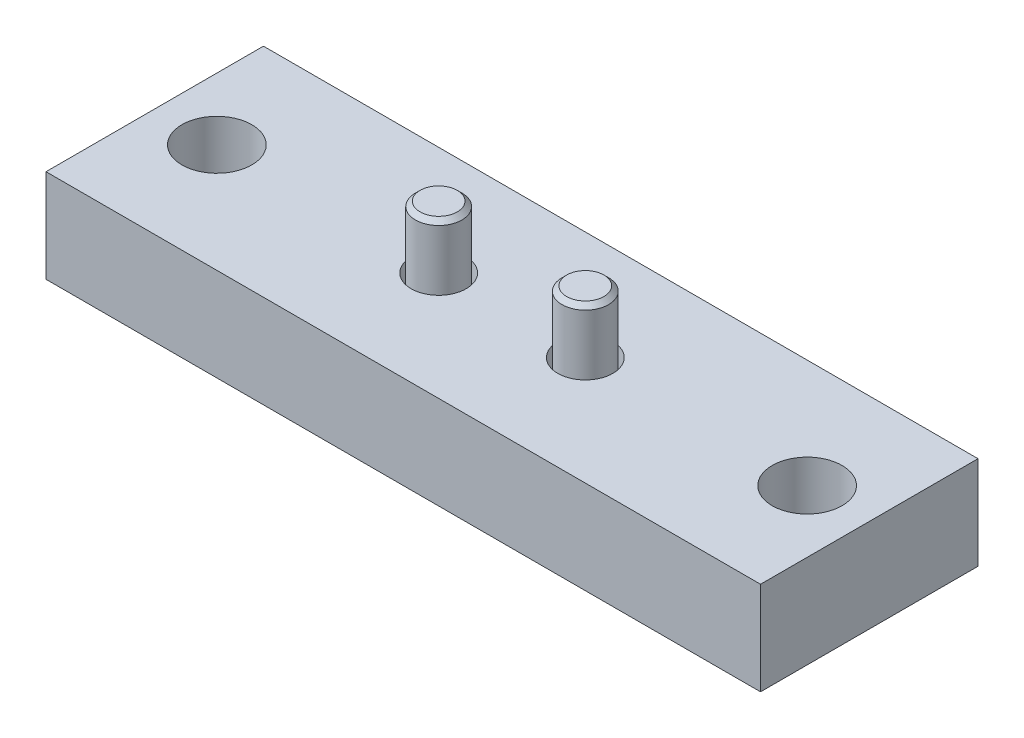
ISO-10303-21;
HEADER;
FILE_DESCRIPTION(('STEP AP214'),'2;1');
FILE_NAME('part.step','',(''),(''),'','','');
FILE_SCHEMA(('AUTOMOTIVE_DESIGN { 1 0 10303 214 1 1 1 1 }'));
ENDSEC;
DATA;
#1=APPLICATION_CONTEXT('core data for automotive mechanical design processes');
#2=APPLICATION_PROTOCOL_DEFINITION('international standard','automotive_design',2000,#1);
#3=PRODUCT_CONTEXT('',#1,'mechanical');
#4=PRODUCT('Part','Part','',(#3));
#5=PRODUCT_RELATED_PRODUCT_CATEGORY('part','',(#4));
#6=PRODUCT_DEFINITION_FORMATION('','',#4);
#7=PRODUCT_DEFINITION_CONTEXT('part definition',#1,'design');
#8=PRODUCT_DEFINITION('design','',#6,#7);
#9=PRODUCT_DEFINITION_SHAPE('','',#8);
#10=(LENGTH_UNIT() NAMED_UNIT(*) SI_UNIT(.MILLI.,.METRE.));
#11=(NAMED_UNIT(*) PLANE_ANGLE_UNIT() SI_UNIT($,.RADIAN.));
#12=(NAMED_UNIT(*) SI_UNIT($,.STERADIAN.) SOLID_ANGLE_UNIT());
#13=UNCERTAINTY_MEASURE_WITH_UNIT(LENGTH_MEASURE(1.E-05),#10,'distance_accuracy_value','');
#14=(GEOMETRIC_REPRESENTATION_CONTEXT(3) GLOBAL_UNCERTAINTY_ASSIGNED_CONTEXT((#13)) GLOBAL_UNIT_ASSIGNED_CONTEXT((#10,
#11,#12)) REPRESENTATION_CONTEXT('',''));
#15=CARTESIAN_POINT('',(0.,0.,0.));
#16=DIRECTION('',(0.,0.,1.));
#17=DIRECTION('',(1.,0.,0.));
#18=AXIS2_PLACEMENT_3D('',#15,#16,#17);
#19=CARTESIAN_POINT('',(14.986,-19.05,0.));
#20=DIRECTION('',(0.,-1.,0.));
#21=DIRECTION('',(-0.5,0.,0.866025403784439));
#22=AXIS2_PLACEMENT_3D('',#19,#20,#21);
#23=PLANE('',#22);
#24=CARTESIAN_POINT('',(14.986,-19.05,0.));
#25=DIRECTION('',(0.,-1.,0.));
#26=DIRECTION('',(-0.5,0.,0.866025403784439));
#27=AXIS2_PLACEMENT_3D('',#24,#25,#26);
#28=CIRCLE('',#27,9.9187);
#29=CARTESIAN_POINT('',(10.02665,-19.05,8.58984617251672));
#30=VERTEX_POINT('',#29);
#31=EDGE_CURVE('P0_E156',#30,#30,#28,.T.);
#32=ORIENTED_EDGE('',*,*,#31,.T.);
#33=EDGE_LOOP('',(#32));
#34=FACE_BOUND('',#33,.T.);
#35=DIRECTION('',(0.866025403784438,0.,-0.5));
#36=VECTOR('',#35,1.);
#37=CARTESIAN_POINT('',(14.986,-19.05,3.20790243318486));
#38=LINE('',#37,#36);
#39=CARTESIAN_POINT('',(14.986,-19.05,3.20790243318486));
#40=VERTEX_POINT('',#39);
#41=CARTESIAN_POINT('',(17.764125,-19.05,1.60395121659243));
#42=VERTEX_POINT('',#41);
#43=EDGE_CURVE('P0_E112',#40,#42,#38,.T.);
#44=ORIENTED_EDGE('',*,*,#43,.T.);
#45=DIRECTION('',(0.,0.,-1.));
#46=VECTOR('',#45,1.);
#47=CARTESIAN_POINT('',(17.764125,-19.05,1.60395121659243));
#48=LINE('',#47,#46);
#49=CARTESIAN_POINT('',(17.764125,-19.05,-1.60395121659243));
#50=VERTEX_POINT('',#49);
#51=EDGE_CURVE('P0_E30',#42,#50,#48,.T.);
#52=ORIENTED_EDGE('',*,*,#51,.T.);
#53=DIRECTION('',(-0.866025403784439,0.,-0.5));
#54=VECTOR('',#53,1.);
#55=CARTESIAN_POINT('',(17.764125,-19.05,-1.60395121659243));
#56=LINE('',#55,#54);
#57=CARTESIAN_POINT('',(14.986,-19.05,-3.20790243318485));
#58=VERTEX_POINT('',#57);
#59=EDGE_CURVE('P0_E93',#50,#58,#56,.T.);
#60=ORIENTED_EDGE('',*,*,#59,.T.);
#61=DIRECTION('',(-0.866025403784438,0.,0.5));
#62=VECTOR('',#61,1.);
#63=CARTESIAN_POINT('',(14.986,-19.05,-3.20790243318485));
#64=LINE('',#63,#62);
#65=CARTESIAN_POINT('',(12.207875,-19.05,-1.60395121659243));
#66=VERTEX_POINT('',#65);
#67=EDGE_CURVE('P0_E101',#58,#66,#64,.T.);
#68=ORIENTED_EDGE('',*,*,#67,.T.);
#69=DIRECTION('',(0.,0.,1.));
#70=VECTOR('',#69,1.);
#71=CARTESIAN_POINT('',(12.207875,-19.05,-1.60395121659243));
#72=LINE('',#71,#70);
#73=CARTESIAN_POINT('',(12.207875,-19.05,1.60395121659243));
#74=VERTEX_POINT('',#73);
#75=EDGE_CURVE('P0_E116',#66,#74,#72,.T.);
#76=ORIENTED_EDGE('',*,*,#75,.T.);
#77=DIRECTION('',(0.866025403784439,0.,0.5));
#78=VECTOR('',#77,1.);
#79=CARTESIAN_POINT('',(12.207875,-19.05,1.60395121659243));
#80=LINE('',#79,#78);
#81=EDGE_CURVE('P0_E119',#74,#40,#80,.T.);
#82=ORIENTED_EDGE('',*,*,#81,.T.);
#83=EDGE_LOOP('',(#44,#52,#60,#68,#76,#82));
#84=FACE_BOUND('',#83,.T.);
#85=ADVANCED_FACE('P0_F15',(#34,#84),#23,.T.);
#86=CARTESIAN_POINT('',(11.6864432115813,12.7,-1.905));
#87=DIRECTION('',(0.,1.,0.));
#88=DIRECTION('',(0.5,0.,-0.866025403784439));
#89=AXIS2_PLACEMENT_3D('',#86,#87,#88);
#90=PLANE('',#89);
#91=CARTESIAN_POINT('',(14.986,12.7,0.));
#92=DIRECTION('',(0.,-1.,0.));
#93=DIRECTION('',(-0.5,0.,0.866025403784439));
#94=AXIS2_PLACEMENT_3D('',#91,#92,#93);
#95=CIRCLE('',#94,3.81);
#96=CARTESIAN_POINT('',(13.081,12.7,3.29955678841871));
#97=VERTEX_POINT('',#96);
#98=EDGE_CURVE('P0_E10',#97,#97,#95,.T.);
#99=ORIENTED_EDGE('',*,*,#98,.F.);
#100=EDGE_LOOP('',(#99));
#101=FACE_BOUND('',#100,.T.);
#102=ADVANCED_FACE('P0_F17',(#101),#90,.T.);
#103=CARTESIAN_POINT('',(14.986,12.7,0.));
#104=DIRECTION('',(0.,-1.,0.));
#105=DIRECTION('',(-0.5,0.,0.866025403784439));
#106=AXIS2_PLACEMENT_3D('',#103,#104,#105);
#107=CONICAL_SURFACE('',#106,3.81,0.785398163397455);
#108=CARTESIAN_POINT('',(14.986,11.7475,0.));
#109=DIRECTION('',(0.,-1.,0.));
#110=DIRECTION('',(-0.5,0.,0.866025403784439));
#111=AXIS2_PLACEMENT_3D('',#108,#109,#110);
#112=CIRCLE('',#111,4.7625);
#113=CARTESIAN_POINT('',(12.60475,11.7475,4.12444598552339));
#114=VERTEX_POINT('',#113);
#115=EDGE_CURVE('P0_E23',#114,#114,#112,.T.);
#116=ORIENTED_EDGE('',*,*,#115,.F.);
#117=EDGE_LOOP('',(#116));
#118=FACE_BOUND('',#117,.T.);
#119=ORIENTED_EDGE('',*,*,#98,.T.);
#120=EDGE_LOOP('',(#119));
#121=FACE_BOUND('',#120,.T.);
#122=ADVANCED_FACE('P0_F171',(#118,#121),#107,.T.);
#123=CARTESIAN_POINT('',(14.986,-19.05,0.));
#124=DIRECTION('',(0.,-1.,0.));
#125=DIRECTION('',(-0.5,0.,0.866025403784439));
#126=AXIS2_PLACEMENT_3D('',#123,#124,#125);
#127=CYLINDRICAL_SURFACE('',#126,4.7625);
#128=ORIENTED_EDGE('',*,*,#115,.T.);
#129=EDGE_LOOP('',(#128));
#130=FACE_BOUND('',#129,.T.);
#131=CARTESIAN_POINT('',(14.986,-13.09497,0.));
#132=DIRECTION('',(0.,-1.,0.));
#133=DIRECTION('',(-0.5,0.,0.866025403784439));
#134=AXIS2_PLACEMENT_3D('',#131,#132,#133);
#135=CIRCLE('',#134,4.7625);
#136=CARTESIAN_POINT('',(12.60475,-13.09497,4.12444598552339));
#137=VERTEX_POINT('',#136);
#138=EDGE_CURVE('P0_E163',#137,#137,#135,.T.);
#139=ORIENTED_EDGE('',*,*,#138,.F.);
#140=EDGE_LOOP('',(#139));
#141=FACE_BOUND('',#140,.T.);
#142=ADVANCED_FACE('P0_F168',(#130,#141),#127,.T.);
#143=CARTESIAN_POINT('',(14.986,-19.026499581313,0.));
#144=DIRECTION('',(0.,-1.,0.));
#145=DIRECTION('',(-0.5,0.,0.866025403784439));
#146=AXIS2_PLACEMENT_3D('',#143,#144,#145);
#147=CONICAL_SURFACE('',#146,9.9187,0.715584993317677);
#148=ORIENTED_EDGE('',*,*,#138,.T.);
#149=EDGE_LOOP('',(#148));
#150=FACE_BOUND('',#149,.T.);
#151=CARTESIAN_POINT('',(14.986,-19.026499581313,0.));
#152=DIRECTION('',(0.,-1.,0.));
#153=DIRECTION('',(-0.5,0.,0.866025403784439));
#154=AXIS2_PLACEMENT_3D('',#151,#152,#153);
#155=CIRCLE('',#154,9.9187);
#156=CARTESIAN_POINT('',(10.02665,-19.026499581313,8.58984617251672));
#157=VERTEX_POINT('',#156);
#158=EDGE_CURVE('P0_E160',#157,#157,#155,.T.);
#159=ORIENTED_EDGE('',*,*,#158,.F.);
#160=EDGE_LOOP('',(#159));
#161=FACE_BOUND('',#160,.T.);
#162=ADVANCED_FACE('P0_F192',(#150,#161),#147,.T.);
#163=CARTESIAN_POINT('',(14.986,-19.05,0.));
#164=DIRECTION('',(0.,-1.,0.));
#165=DIRECTION('',(-0.5,0.,0.866025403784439));
#166=AXIS2_PLACEMENT_3D('',#163,#164,#165);
#167=CYLINDRICAL_SURFACE('',#166,9.9187);
#168=ORIENTED_EDGE('',*,*,#158,.T.);
#169=EDGE_LOOP('',(#168));
#170=FACE_BOUND('',#169,.T.);
#171=ORIENTED_EDGE('',*,*,#31,.F.);
#172=EDGE_LOOP('',(#171));
#173=FACE_BOUND('',#172,.T.);
#174=ADVANCED_FACE('P0_F189',(#170,#173),#167,.T.);
#175=CARTESIAN_POINT('',(17.764125,-15.621,1.60395121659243));
#176=DIRECTION('',(-1.,0.,0.));
#177=DIRECTION('',(0.,0.,1.));
#178=AXIS2_PLACEMENT_3D('',#175,#176,#177);
#179=PLANE('',#178);
#180=ORIENTED_EDGE('',*,*,#51,.F.);
#181=DIRECTION('',(0.,-1.,0.));
#182=VECTOR('',#181,1.);
#183=CARTESIAN_POINT('',(17.764125,-15.621,1.60395121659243));
#184=LINE('',#183,#182);
#185=CARTESIAN_POINT('',(17.764125,-15.621,1.60395121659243));
#186=VERTEX_POINT('',#185);
#187=EDGE_CURVE('P0_E141',#186,#42,#184,.T.);
#188=ORIENTED_EDGE('',*,*,#187,.F.);
#189=DIRECTION('',(0.,0.,-1.));
#190=VECTOR('',#189,1.);
#191=CARTESIAN_POINT('',(17.764125,-15.621,1.60395121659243));
#192=LINE('',#191,#190);
#193=CARTESIAN_POINT('',(17.764125,-15.621,0.));
#194=VERTEX_POINT('',#193);
#195=EDGE_CURVE('P0_E122',#186,#194,#192,.T.);
#196=ORIENTED_EDGE('',*,*,#195,.T.);
#197=CARTESIAN_POINT('',(17.764125,-15.621,-1.60395121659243));
#198=VERTEX_POINT('',#197);
#199=EDGE_CURVE('P0_E106',#194,#198,#192,.T.);
#200=ORIENTED_EDGE('',*,*,#199,.T.);
#201=DIRECTION('',(0.,-1.,0.));
#202=VECTOR('',#201,1.);
#203=CARTESIAN_POINT('',(17.764125,-15.621,-1.60395121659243));
#204=LINE('',#203,#202);
#205=EDGE_CURVE('P0_E96',#198,#50,#204,.T.);
#206=ORIENTED_EDGE('',*,*,#205,.T.);
#207=EDGE_LOOP('',(#180,#188,#196,#200,#206));
#208=FACE_BOUND('',#207,.T.);
#209=ADVANCED_FACE('P0_F103',(#208),#179,.T.);
#210=CARTESIAN_POINT('',(17.764125,-15.621,-1.60395121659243));
#211=DIRECTION('',(-0.5,0.,0.866025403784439));
#212=DIRECTION('',(0.866025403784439,0.,0.5));
#213=AXIS2_PLACEMENT_3D('',#210,#211,#212);
#214=PLANE('',#213);
#215=ORIENTED_EDGE('',*,*,#59,.F.);
#216=ORIENTED_EDGE('',*,*,#205,.F.);
#217=DIRECTION('',(-0.866025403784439,0.,-0.5));
#218=VECTOR('',#217,1.);
#219=CARTESIAN_POINT('',(17.764125,-15.621,-1.60395121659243));
#220=LINE('',#219,#218);
#221=CARTESIAN_POINT('',(16.3750625,-15.621,-2.40592682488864));
#222=VERTEX_POINT('',#221);
#223=EDGE_CURVE('P0_E125',#198,#222,#220,.T.);
#224=ORIENTED_EDGE('',*,*,#223,.T.);
#225=CARTESIAN_POINT('',(14.986,-15.621,-3.20790243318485));
#226=VERTEX_POINT('',#225);
#227=EDGE_CURVE('P0_E124',#222,#226,#220,.T.);
#228=ORIENTED_EDGE('',*,*,#227,.T.);
#229=DIRECTION('',(0.,-1.,0.));
#230=VECTOR('',#229,1.);
#231=CARTESIAN_POINT('',(14.986,-15.621,-3.20790243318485));
#232=LINE('',#231,#230);
#233=EDGE_CURVE('P0_E98',#226,#58,#232,.T.);
#234=ORIENTED_EDGE('',*,*,#233,.T.);
#235=EDGE_LOOP('',(#215,#216,#224,#228,#234));
#236=FACE_BOUND('',#235,.T.);
#237=ADVANCED_FACE('P0_F94',(#236),#214,.T.);
#238=CARTESIAN_POINT('',(14.986,-15.621,-3.20790243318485));
#239=DIRECTION('',(0.5,0.,0.866025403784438));
#240=DIRECTION('',(0.866025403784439,0.,-0.5));
#241=AXIS2_PLACEMENT_3D('',#238,#239,#240);
#242=PLANE('',#241);
#243=ORIENTED_EDGE('',*,*,#67,.F.);
#244=ORIENTED_EDGE('',*,*,#233,.F.);
#245=DIRECTION('',(-0.866025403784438,0.,0.5));
#246=VECTOR('',#245,1.);
#247=CARTESIAN_POINT('',(14.986,-15.621,-3.20790243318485));
#248=LINE('',#247,#246);
#249=CARTESIAN_POINT('',(13.5969375,-15.621,-2.40592682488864));
#250=VERTEX_POINT('',#249);
#251=EDGE_CURVE('P0_E128',#226,#250,#248,.T.);
#252=ORIENTED_EDGE('',*,*,#251,.T.);
#253=CARTESIAN_POINT('',(12.207875,-15.621,-1.60395121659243));
#254=VERTEX_POINT('',#253);
#255=EDGE_CURVE('P0_E127',#250,#254,#248,.T.);
#256=ORIENTED_EDGE('',*,*,#255,.T.);
#257=DIRECTION('',(0.,-1.,0.));
#258=VECTOR('',#257,1.);
#259=CARTESIAN_POINT('',(12.207875,-15.621,-1.60395121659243));
#260=LINE('',#259,#258);
#261=EDGE_CURVE('P0_E149',#254,#66,#260,.T.);
#262=ORIENTED_EDGE('',*,*,#261,.T.);
#263=EDGE_LOOP('',(#243,#244,#252,#256,#262));
#264=FACE_BOUND('',#263,.T.);
#265=ADVANCED_FACE('P0_F224',(#264),#242,.T.);
#266=CARTESIAN_POINT('',(12.207875,-15.621,-1.60395121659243));
#267=DIRECTION('',(1.,0.,0.));
#268=DIRECTION('',(0.,0.,-1.));
#269=AXIS2_PLACEMENT_3D('',#266,#267,#268);
#270=PLANE('',#269);
#271=ORIENTED_EDGE('',*,*,#75,.F.);
#272=ORIENTED_EDGE('',*,*,#261,.F.);
#273=DIRECTION('',(0.,0.,1.));
#274=VECTOR('',#273,1.);
#275=CARTESIAN_POINT('',(12.207875,-15.621,-1.60395121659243));
#276=LINE('',#275,#274);
#277=CARTESIAN_POINT('',(12.207875,-15.621,0.));
#278=VERTEX_POINT('',#277);
#279=EDGE_CURVE('P0_E38',#254,#278,#276,.T.);
#280=ORIENTED_EDGE('',*,*,#279,.T.);
#281=CARTESIAN_POINT('',(12.207875,-15.621,1.60395121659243));
#282=VERTEX_POINT('',#281);
#283=EDGE_CURVE('P0_E131',#278,#282,#276,.T.);
#284=ORIENTED_EDGE('',*,*,#283,.T.);
#285=DIRECTION('',(0.,-1.,0.));
#286=VECTOR('',#285,1.);
#287=CARTESIAN_POINT('',(12.207875,-15.621,1.60395121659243));
#288=LINE('',#287,#286);
#289=EDGE_CURVE('P0_E146',#282,#74,#288,.T.);
#290=ORIENTED_EDGE('',*,*,#289,.T.);
#291=EDGE_LOOP('',(#271,#272,#280,#284,#290));
#292=FACE_BOUND('',#291,.T.);
#293=ADVANCED_FACE('P0_F231',(#292),#270,.T.);
#294=CARTESIAN_POINT('',(12.207875,-15.621,1.60395121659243));
#295=DIRECTION('',(0.5,0.,-0.866025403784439));
#296=DIRECTION('',(0.,-1.,0.));
#297=AXIS2_PLACEMENT_3D('',#294,#295,#296);
#298=PLANE('',#297);
#299=ORIENTED_EDGE('',*,*,#81,.F.);
#300=ORIENTED_EDGE('',*,*,#289,.F.);
#301=DIRECTION('',(0.866025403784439,0.,0.5));
#302=VECTOR('',#301,1.);
#303=CARTESIAN_POINT('',(12.207875,-15.621,1.60395121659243));
#304=LINE('',#303,#302);
#305=CARTESIAN_POINT('',(13.5969375,-15.621,2.40592682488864));
#306=VERTEX_POINT('',#305);
#307=EDGE_CURVE('P0_E134',#282,#306,#304,.T.);
#308=ORIENTED_EDGE('',*,*,#307,.T.);
#309=CARTESIAN_POINT('',(14.986,-15.621,3.20790243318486));
#310=VERTEX_POINT('',#309);
#311=EDGE_CURVE('P0_E133',#306,#310,#304,.T.);
#312=ORIENTED_EDGE('',*,*,#311,.T.);
#313=DIRECTION('',(0.,-1.,0.));
#314=VECTOR('',#313,1.);
#315=CARTESIAN_POINT('',(14.986,-15.621,3.20790243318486));
#316=LINE('',#315,#314);
#317=EDGE_CURVE('P0_E143',#310,#40,#316,.T.);
#318=ORIENTED_EDGE('',*,*,#317,.T.);
#319=EDGE_LOOP('',(#299,#300,#308,#312,#318));
#320=FACE_BOUND('',#319,.T.);
#321=ADVANCED_FACE('P0_F239',(#320),#298,.T.);
#322=CARTESIAN_POINT('',(14.986,-15.621,3.20790243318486));
#323=DIRECTION('',(-0.5,0.,-0.866025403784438));
#324=DIRECTION('',(-0.866025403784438,0.,0.5));
#325=AXIS2_PLACEMENT_3D('',#322,#323,#324);
#326=PLANE('',#325);
#327=ORIENTED_EDGE('',*,*,#43,.F.);
#328=ORIENTED_EDGE('',*,*,#317,.F.);
#329=DIRECTION('',(0.866025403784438,0.,-0.5));
#330=VECTOR('',#329,1.);
#331=CARTESIAN_POINT('',(14.986,-15.621,3.20790243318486));
#332=LINE('',#331,#330);
#333=CARTESIAN_POINT('',(16.3750625,-15.621,2.40592682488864));
#334=VERTEX_POINT('',#333);
#335=EDGE_CURVE('P0_E138',#310,#334,#332,.T.);
#336=ORIENTED_EDGE('',*,*,#335,.T.);
#337=EDGE_CURVE('P0_E137',#334,#186,#332,.T.);
#338=ORIENTED_EDGE('',*,*,#337,.T.);
#339=ORIENTED_EDGE('',*,*,#187,.T.);
#340=EDGE_LOOP('',(#327,#328,#336,#338,#339));
#341=FACE_BOUND('',#340,.T.);
#342=ADVANCED_FACE('P0_F246',(#341),#326,.T.);
#343=CARTESIAN_POINT('',(17.764125,-15.621,4.81185364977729));
#344=DIRECTION('',(0.,-1.,0.));
#345=DIRECTION('',(-0.5,0.,0.866025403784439));
#346=AXIS2_PLACEMENT_3D('',#343,#344,#345);
#347=PLANE('',#346);
#348=CARTESIAN_POINT('',(14.986,-15.621,0.));
#349=DIRECTION('',(0.,-1.,0.));
#350=DIRECTION('',(-0.5,0.,0.866025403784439));
#351=AXIS2_PLACEMENT_3D('',#348,#349,#350);
#352=CIRCLE('',#351,2.778125);
#353=EDGE_CURVE('P0_E108',#334,#306,#352,.T.);
#354=ORIENTED_EDGE('',*,*,#353,.F.);
#355=ORIENTED_EDGE('',*,*,#335,.F.);
#356=ORIENTED_EDGE('',*,*,#311,.F.);
#357=EDGE_LOOP('',(#354,#355,#356));
#358=FACE_BOUND('',#357,.T.);
#359=ADVANCED_FACE('P0_F254',(#358),#347,.T.);
#360=EDGE_CURVE('P0_E412',#194,#334,#352,.T.);
#361=ORIENTED_EDGE('',*,*,#360,.F.);
#362=ORIENTED_EDGE('',*,*,#195,.F.);
#363=ORIENTED_EDGE('',*,*,#337,.F.);
#364=EDGE_LOOP('',(#361,#362,#363));
#365=FACE_BOUND('',#364,.T.);
#366=ADVANCED_FACE('P0_F262',(#365),#347,.T.);
#367=EDGE_CURVE('P0_E410',#222,#194,#352,.T.);
#368=ORIENTED_EDGE('',*,*,#367,.F.);
#369=ORIENTED_EDGE('',*,*,#223,.F.);
#370=ORIENTED_EDGE('',*,*,#199,.F.);
#371=EDGE_LOOP('',(#368,#369,#370));
#372=FACE_BOUND('',#371,.T.);
#373=ADVANCED_FACE('P0_F271',(#372),#347,.T.);
#374=EDGE_CURVE('P0_E409',#250,#222,#352,.T.);
#375=ORIENTED_EDGE('',*,*,#374,.F.);
#376=ORIENTED_EDGE('',*,*,#251,.F.);
#377=ORIENTED_EDGE('',*,*,#227,.F.);
#378=EDGE_LOOP('',(#375,#376,#377));
#379=FACE_BOUND('',#378,.T.);
#380=ADVANCED_FACE('P0_F278',(#379),#347,.T.);
#381=EDGE_CURVE('P0_E157',#278,#250,#352,.T.);
#382=ORIENTED_EDGE('',*,*,#381,.F.);
#383=ORIENTED_EDGE('',*,*,#279,.F.);
#384=ORIENTED_EDGE('',*,*,#255,.F.);
#385=EDGE_LOOP('',(#382,#383,#384));
#386=FACE_BOUND('',#385,.T.);
#387=ADVANCED_FACE('P0_F285',(#386),#347,.T.);
#388=EDGE_CURVE('P0_E153',#306,#278,#352,.T.);
#389=ORIENTED_EDGE('',*,*,#388,.F.);
#390=ORIENTED_EDGE('',*,*,#307,.F.);
#391=ORIENTED_EDGE('',*,*,#283,.F.);
#392=EDGE_LOOP('',(#389,#390,#391));
#393=FACE_BOUND('',#392,.T.);
#394=ADVANCED_FACE('P0_F265',(#393),#347,.T.);
#395=CARTESIAN_POINT('',(14.986,-15.621,0.));
#396=DIRECTION('',(0.,-1.,0.));
#397=DIRECTION('',(-0.5,0.,0.866025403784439));
#398=AXIS2_PLACEMENT_3D('',#395,#396,#397);
#399=CONICAL_SURFACE('',#398,2.778125,1.0471975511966);
#400=CARTESIAN_POINT('',(14.986,-14.0170487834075,0.));
#401=VERTEX_POINT('',#400);
#402=VERTEX_LOOP('',#401);
#403=FACE_BOUND('',#402,.T.);
#404=ORIENTED_EDGE('',*,*,#388,.T.);
#405=ORIENTED_EDGE('',*,*,#381,.T.);
#406=ORIENTED_EDGE('',*,*,#374,.T.);
#407=ORIENTED_EDGE('',*,*,#367,.T.);
#408=ORIENTED_EDGE('',*,*,#360,.T.);
#409=ORIENTED_EDGE('',*,*,#353,.T.);
#410=EDGE_LOOP('',(#404,#405,#406,#407,#408,#409));
#411=FACE_BOUND('',#410,.T.);
#412=ADVANCED_FACE('P0_F187',(#403,#411),#399,.F.);
#413=CLOSED_SHELL('',(#85,#102,#122,#142,#162,#174,#209,#237,#265,#293,#321,#342,#359,#366,#373,
#380,#387,#394,#412));
#414=MANIFOLD_SOLID_BREP('P0_B1',#413);
#415=CARTESIAN_POINT('',(-14.986,-19.05,0.));
#416=DIRECTION('',(0.,-1.,0.));
#417=DIRECTION('',(-0.5,0.,0.866025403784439));
#418=AXIS2_PLACEMENT_3D('',#415,#416,#417);
#419=PLANE('',#418);
#420=CARTESIAN_POINT('',(-14.986,-19.05,0.));
#421=DIRECTION('',(0.,-1.,0.));
#422=DIRECTION('',(-0.5,0.,0.866025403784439));
#423=AXIS2_PLACEMENT_3D('',#420,#421,#422);
#424=CIRCLE('',#423,9.9187);
#425=CARTESIAN_POINT('',(-19.94535,-19.05,8.58984617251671));
#426=VERTEX_POINT('',#425);
#427=EDGE_CURVE('P1_E174',#426,#426,#424,.T.);
#428=ORIENTED_EDGE('',*,*,#427,.T.);
#429=EDGE_LOOP('',(#428));
#430=FACE_BOUND('',#429,.T.);
#431=DIRECTION('',(0.866025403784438,0.,-0.5));
#432=VECTOR('',#431,1.);
#433=CARTESIAN_POINT('',(-14.986,-19.05,3.20790243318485));
#434=LINE('',#433,#432);
#435=CARTESIAN_POINT('',(-14.986,-19.05,3.20790243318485));
#436=VERTEX_POINT('',#435);
#437=CARTESIAN_POINT('',(-12.207875,-19.05,1.60395121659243));
#438=VERTEX_POINT('',#437);
#439=EDGE_CURVE('P1_E102',#436,#438,#434,.T.);
#440=ORIENTED_EDGE('',*,*,#439,.T.);
#441=DIRECTION('',(0.,0.,-1.));
#442=VECTOR('',#441,1.);
#443=CARTESIAN_POINT('',(-12.207875,-19.05,1.60395121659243));
#444=LINE('',#443,#442);
#445=CARTESIAN_POINT('',(-12.207875,-19.05,-1.60395121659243));
#446=VERTEX_POINT('',#445);
#447=EDGE_CURVE('P1_E11',#438,#446,#444,.T.);
#448=ORIENTED_EDGE('',*,*,#447,.T.);
#449=DIRECTION('',(-0.866025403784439,0.,-0.5));
#450=VECTOR('',#449,1.);
#451=CARTESIAN_POINT('',(-12.207875,-19.05,-1.60395121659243));
#452=LINE('',#451,#450);
#453=CARTESIAN_POINT('',(-14.986,-19.05,-3.20790243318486));
#454=VERTEX_POINT('',#453);
#455=EDGE_CURVE('P1_E24',#446,#454,#452,.T.);
#456=ORIENTED_EDGE('',*,*,#455,.T.);
#457=DIRECTION('',(-0.866025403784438,0.,0.5));
#458=VECTOR('',#457,1.);
#459=CARTESIAN_POINT('',(-14.986,-19.05,-3.20790243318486));
#460=LINE('',#459,#458);
#461=CARTESIAN_POINT('',(-17.764125,-19.05,-1.60395121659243));
#462=VERTEX_POINT('',#461);
#463=EDGE_CURVE('P1_E38',#454,#462,#460,.T.);
#464=ORIENTED_EDGE('',*,*,#463,.T.);
#465=DIRECTION('',(0.,0.,1.));
#466=VECTOR('',#465,1.);
#467=CARTESIAN_POINT('',(-17.764125,-19.05,-1.60395121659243));
#468=LINE('',#467,#466);
#469=CARTESIAN_POINT('',(-17.764125,-19.05,1.60395121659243));
#470=VERTEX_POINT('',#469);
#471=EDGE_CURVE('P1_E115',#462,#470,#468,.T.);
#472=ORIENTED_EDGE('',*,*,#471,.T.);
#473=DIRECTION('',(0.866025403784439,0.,0.5));
#474=VECTOR('',#473,1.);
#475=CARTESIAN_POINT('',(-17.764125,-19.05,1.60395121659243));
#476=LINE('',#475,#474);
#477=EDGE_CURVE('P1_E112',#470,#436,#476,.T.);
#478=ORIENTED_EDGE('',*,*,#477,.T.);
#479=EDGE_LOOP('',(#440,#448,#456,#464,#472,#478));
#480=FACE_BOUND('',#479,.T.);
#481=ADVANCED_FACE('P1_F16',(#430,#480),#419,.T.);
#482=CARTESIAN_POINT('',(-18.2855567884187,12.7,-1.905));
#483=DIRECTION('',(0.,1.,0.));
#484=DIRECTION('',(0.5,0.,-0.866025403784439));
#485=AXIS2_PLACEMENT_3D('',#482,#483,#484);
#486=PLANE('',#485);
#487=CARTESIAN_POINT('',(-14.986,12.7,0.));
#488=DIRECTION('',(0.,-1.,0.));
#489=DIRECTION('',(-0.5,0.,0.866025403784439));
#490=AXIS2_PLACEMENT_3D('',#487,#488,#489);
#491=CIRCLE('',#490,3.81);
#492=CARTESIAN_POINT('',(-16.891,12.7,3.29955678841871));
#493=VERTEX_POINT('',#492);
#494=EDGE_CURVE('P1_E405',#493,#493,#491,.T.);
#495=ORIENTED_EDGE('',*,*,#494,.F.);
#496=EDGE_LOOP('',(#495));
#497=FACE_BOUND('',#496,.T.);
#498=ADVANCED_FACE('P1_F200',(#497),#486,.T.);
#499=CARTESIAN_POINT('',(-14.986,12.7,0.));
#500=DIRECTION('',(0.,-1.,0.));
#501=DIRECTION('',(-0.5,0.,0.866025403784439));
#502=AXIS2_PLACEMENT_3D('',#499,#500,#501);
#503=CONICAL_SURFACE('',#502,3.81,0.785398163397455);
#504=CARTESIAN_POINT('',(-14.986,11.7475,0.));
#505=DIRECTION('',(0.,-1.,0.));
#506=DIRECTION('',(-0.5,0.,0.866025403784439));
#507=AXIS2_PLACEMENT_3D('',#504,#505,#506);
#508=CIRCLE('',#507,4.7625);
#509=CARTESIAN_POINT('',(-17.36725,11.7475,4.12444598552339));
#510=VERTEX_POINT('',#509);
#511=EDGE_CURVE('P1_E402',#510,#510,#508,.T.);
#512=ORIENTED_EDGE('',*,*,#511,.F.);
#513=EDGE_LOOP('',(#512));
#514=FACE_BOUND('',#513,.T.);
#515=ORIENTED_EDGE('',*,*,#494,.T.);
#516=EDGE_LOOP('',(#515));
#517=FACE_BOUND('',#516,.T.);
#518=ADVANCED_FACE('P1_F206',(#514,#517),#503,.T.);
#519=CARTESIAN_POINT('',(-14.986,-19.05,0.));
#520=DIRECTION('',(0.,-1.,0.));
#521=DIRECTION('',(-0.5,0.,0.866025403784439));
#522=AXIS2_PLACEMENT_3D('',#519,#520,#521);
#523=CYLINDRICAL_SURFACE('',#522,4.7625);
#524=ORIENTED_EDGE('',*,*,#511,.T.);
#525=EDGE_LOOP('',(#524));
#526=FACE_BOUND('',#525,.T.);
#527=CARTESIAN_POINT('',(-14.986,-13.09497,0.));
#528=DIRECTION('',(0.,-1.,0.));
#529=DIRECTION('',(-0.5,0.,0.866025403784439));
#530=AXIS2_PLACEMENT_3D('',#527,#528,#529);
#531=CIRCLE('',#530,4.7625);
#532=CARTESIAN_POINT('',(-17.36725,-13.09497,4.12444598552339));
#533=VERTEX_POINT('',#532);
#534=EDGE_CURVE('P1_E407',#533,#533,#531,.T.);
#535=ORIENTED_EDGE('',*,*,#534,.F.);
#536=EDGE_LOOP('',(#535));
#537=FACE_BOUND('',#536,.T.);
#538=ADVANCED_FACE('P1_F353',(#526,#537),#523,.T.);
#539=CARTESIAN_POINT('',(-14.986,-19.026499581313,0.));
#540=DIRECTION('',(0.,-1.,0.));
#541=DIRECTION('',(-0.5,0.,0.866025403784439));
#542=AXIS2_PLACEMENT_3D('',#539,#540,#541);
#543=CONICAL_SURFACE('',#542,9.9187,0.715584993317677);
#544=ORIENTED_EDGE('',*,*,#534,.T.);
#545=EDGE_LOOP('',(#544));
#546=FACE_BOUND('',#545,.T.);
#547=CARTESIAN_POINT('',(-14.986,-19.026499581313,0.));
#548=DIRECTION('',(0.,-1.,0.));
#549=DIRECTION('',(-0.5,0.,0.866025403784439));
#550=AXIS2_PLACEMENT_3D('',#547,#548,#549);
#551=CIRCLE('',#550,9.9187);
#552=CARTESIAN_POINT('',(-19.94535,-19.026499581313,8.58984617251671));
#553=VERTEX_POINT('',#552);
#554=EDGE_CURVE('P1_E411',#553,#553,#551,.T.);
#555=ORIENTED_EDGE('',*,*,#554,.F.);
#556=EDGE_LOOP('',(#555));
#557=FACE_BOUND('',#556,.T.);
#558=ADVANCED_FACE('P1_F343',(#546,#557),#543,.T.);
#559=CARTESIAN_POINT('',(-14.986,-19.05,0.));
#560=DIRECTION('',(0.,-1.,0.));
#561=DIRECTION('',(-0.5,0.,0.866025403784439));
#562=AXIS2_PLACEMENT_3D('',#559,#560,#561);
#563=CYLINDRICAL_SURFACE('',#562,9.9187);
#564=ORIENTED_EDGE('',*,*,#554,.T.);
#565=EDGE_LOOP('',(#564));
#566=FACE_BOUND('',#565,.T.);
#567=ORIENTED_EDGE('',*,*,#427,.F.);
#568=EDGE_LOOP('',(#567));
#569=FACE_BOUND('',#568,.T.);
#570=ADVANCED_FACE('P1_F212',(#566,#569),#563,.T.);
#571=CARTESIAN_POINT('',(-12.207875,-15.621,1.60395121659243));
#572=DIRECTION('',(-1.,0.,0.));
#573=DIRECTION('',(0.,0.,1.));
#574=AXIS2_PLACEMENT_3D('',#571,#572,#573);
#575=PLANE('',#574);
#576=ORIENTED_EDGE('',*,*,#447,.F.);
#577=DIRECTION('',(0.,-1.,0.));
#578=VECTOR('',#577,1.);
#579=CARTESIAN_POINT('',(-12.207875,-15.621,1.60395121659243));
#580=LINE('',#579,#578);
#581=CARTESIAN_POINT('',(-12.207875,-15.621,1.60395121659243));
#582=VERTEX_POINT('',#581);
#583=EDGE_CURVE('P1_E94',#582,#438,#580,.T.);
#584=ORIENTED_EDGE('',*,*,#583,.F.);
#585=DIRECTION('',(0.,0.,-1.));
#586=VECTOR('',#585,1.);
#587=CARTESIAN_POINT('',(-12.207875,-15.621,1.60395121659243));
#588=LINE('',#587,#586);
#589=CARTESIAN_POINT('',(-12.207875,-15.621,0.));
#590=VERTEX_POINT('',#589);
#591=EDGE_CURVE('P1_E117',#582,#590,#588,.T.);
#592=ORIENTED_EDGE('',*,*,#591,.T.);
#593=CARTESIAN_POINT('',(-12.207875,-15.621,-1.60395121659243));
#594=VERTEX_POINT('',#593);
#595=EDGE_CURVE('P1_E113',#590,#594,#588,.T.);
#596=ORIENTED_EDGE('',*,*,#595,.T.);
#597=DIRECTION('',(0.,-1.,0.));
#598=VECTOR('',#597,1.);
#599=CARTESIAN_POINT('',(-12.207875,-15.621,-1.60395121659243));
#600=LINE('',#599,#598);
#601=EDGE_CURVE('P1_E96',#594,#446,#600,.T.);
#602=ORIENTED_EDGE('',*,*,#601,.T.);
#603=EDGE_LOOP('',(#576,#584,#592,#596,#602));
#604=FACE_BOUND('',#603,.T.);
#605=ADVANCED_FACE('P1_F92',(#604),#575,.T.);
#606=CARTESIAN_POINT('',(-12.207875,-15.621,-1.60395121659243));
#607=DIRECTION('',(-0.5,0.,0.866025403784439));
#608=DIRECTION('',(0.866025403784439,0.,0.5));
#609=AXIS2_PLACEMENT_3D('',#606,#607,#608);
#610=PLANE('',#609);
#611=ORIENTED_EDGE('',*,*,#455,.F.);
#612=ORIENTED_EDGE('',*,*,#601,.F.);
#613=DIRECTION('',(-0.866025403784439,0.,-0.5));
#614=VECTOR('',#613,1.);
#615=CARTESIAN_POINT('',(-12.207875,-15.621,-1.60395121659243));
#616=LINE('',#615,#614);
#617=CARTESIAN_POINT('',(-13.5969375,-15.621,-2.40592682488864));
#618=VERTEX_POINT('',#617);
#619=EDGE_CURVE('P1_E150',#594,#618,#616,.T.);
#620=ORIENTED_EDGE('',*,*,#619,.T.);
#621=CARTESIAN_POINT('',(-14.986,-15.621,-3.20790243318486));
#622=VERTEX_POINT('',#621);
#623=EDGE_CURVE('P1_E152',#618,#622,#616,.T.);
#624=ORIENTED_EDGE('',*,*,#623,.T.);
#625=DIRECTION('',(0.,-1.,0.));
#626=VECTOR('',#625,1.);
#627=CARTESIAN_POINT('',(-14.986,-15.621,-3.20790243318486));
#628=LINE('',#627,#626);
#629=EDGE_CURVE('P1_E134',#622,#454,#628,.T.);
#630=ORIENTED_EDGE('',*,*,#629,.T.);
#631=EDGE_LOOP('',(#611,#612,#620,#624,#630));
#632=FACE_BOUND('',#631,.T.);
#633=ADVANCED_FACE('P1_F219',(#632),#610,.T.);
#634=CARTESIAN_POINT('',(-14.986,-15.621,-3.20790243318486));
#635=DIRECTION('',(0.5,0.,0.866025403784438));
#636=DIRECTION('',(0.866025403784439,0.,-0.5));
#637=AXIS2_PLACEMENT_3D('',#634,#635,#636);
#638=PLANE('',#637);
#639=ORIENTED_EDGE('',*,*,#463,.F.);
#640=ORIENTED_EDGE('',*,*,#629,.F.);
#641=DIRECTION('',(-0.866025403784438,0.,0.5));
#642=VECTOR('',#641,1.);
#643=CARTESIAN_POINT('',(-14.986,-15.621,-3.20790243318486));
#644=LINE('',#643,#642);
#645=CARTESIAN_POINT('',(-16.3750625,-15.621,-2.40592682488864));
#646=VERTEX_POINT('',#645);
#647=EDGE_CURVE('P1_E149',#622,#646,#644,.T.);
#648=ORIENTED_EDGE('',*,*,#647,.T.);
#649=CARTESIAN_POINT('',(-17.764125,-15.621,-1.60395121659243));
#650=VERTEX_POINT('',#649);
#651=EDGE_CURVE('P1_E133',#646,#650,#644,.T.);
#652=ORIENTED_EDGE('',*,*,#651,.T.);
#653=DIRECTION('',(0.,-1.,0.));
#654=VECTOR('',#653,1.);
#655=CARTESIAN_POINT('',(-17.764125,-15.621,-1.60395121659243));
#656=LINE('',#655,#654);
#657=EDGE_CURVE('P1_E126',#650,#462,#656,.T.);
#658=ORIENTED_EDGE('',*,*,#657,.T.);
#659=EDGE_LOOP('',(#639,#640,#648,#652,#658));
#660=FACE_BOUND('',#659,.T.);
#661=ADVANCED_FACE('P1_F130',(#660),#638,.T.);
#662=CARTESIAN_POINT('',(-17.764125,-15.621,-1.60395121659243));
#663=DIRECTION('',(1.,0.,0.));
#664=DIRECTION('',(0.,0.,-1.));
#665=AXIS2_PLACEMENT_3D('',#662,#663,#664);
#666=PLANE('',#665);
#667=ORIENTED_EDGE('',*,*,#471,.F.);
#668=ORIENTED_EDGE('',*,*,#657,.F.);
#669=DIRECTION('',(0.,0.,1.));
#670=VECTOR('',#669,1.);
#671=CARTESIAN_POINT('',(-17.764125,-15.621,-1.60395121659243));
#672=LINE('',#671,#670);
#673=CARTESIAN_POINT('',(-17.764125,-15.621,0.));
#674=VERTEX_POINT('',#673);
#675=EDGE_CURVE('P1_E146',#650,#674,#672,.T.);
#676=ORIENTED_EDGE('',*,*,#675,.T.);
#677=CARTESIAN_POINT('',(-17.764125,-15.621,1.60395121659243));
#678=VERTEX_POINT('',#677);
#679=EDGE_CURVE('P1_E148',#674,#678,#672,.T.);
#680=ORIENTED_EDGE('',*,*,#679,.T.);
#681=DIRECTION('',(0.,-1.,0.));
#682=VECTOR('',#681,1.);
#683=CARTESIAN_POINT('',(-17.764125,-15.621,1.60395121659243));
#684=LINE('',#683,#682);
#685=EDGE_CURVE('P1_E129',#678,#470,#684,.T.);
#686=ORIENTED_EDGE('',*,*,#685,.T.);
#687=EDGE_LOOP('',(#667,#668,#676,#680,#686));
#688=FACE_BOUND('',#687,.T.);
#689=ADVANCED_FACE('P1_F125',(#688),#666,.T.);
#690=CARTESIAN_POINT('',(-17.764125,-15.621,1.60395121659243));
#691=DIRECTION('',(0.5,0.,-0.866025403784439));
#692=DIRECTION('',(0.,-1.,0.));
#693=AXIS2_PLACEMENT_3D('',#690,#691,#692);
#694=PLANE('',#693);
#695=ORIENTED_EDGE('',*,*,#477,.F.);
#696=ORIENTED_EDGE('',*,*,#685,.F.);
#697=DIRECTION('',(0.866025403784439,0.,0.5));
#698=VECTOR('',#697,1.);
#699=CARTESIAN_POINT('',(-17.764125,-15.621,1.60395121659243));
#700=LINE('',#699,#698);
#701=CARTESIAN_POINT('',(-16.3750625,-15.621,2.40592682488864));
#702=VERTEX_POINT('',#701);
#703=EDGE_CURVE('P1_E142',#678,#702,#700,.T.);
#704=ORIENTED_EDGE('',*,*,#703,.T.);
#705=CARTESIAN_POINT('',(-14.986,-15.621,3.20790243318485));
#706=VERTEX_POINT('',#705);
#707=EDGE_CURVE('P1_E145',#702,#706,#700,.T.);
#708=ORIENTED_EDGE('',*,*,#707,.T.);
#709=DIRECTION('',(0.,-1.,0.));
#710=VECTOR('',#709,1.);
#711=CARTESIAN_POINT('',(-14.986,-15.621,3.20790243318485));
#712=LINE('',#711,#710);
#713=EDGE_CURVE('P1_E108',#706,#436,#712,.T.);
#714=ORIENTED_EDGE('',*,*,#713,.T.);
#715=EDGE_LOOP('',(#695,#696,#704,#708,#714));
#716=FACE_BOUND('',#715,.T.);
#717=ADVANCED_FACE('P1_F181',(#716),#694,.T.);
#718=CARTESIAN_POINT('',(-14.986,-15.621,3.20790243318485));
#719=DIRECTION('',(-0.5,0.,-0.866025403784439));
#720=DIRECTION('',(-0.866025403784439,0.,0.5));
#721=AXIS2_PLACEMENT_3D('',#718,#719,#720);
#722=PLANE('',#721);
#723=ORIENTED_EDGE('',*,*,#439,.F.);
#724=ORIENTED_EDGE('',*,*,#713,.F.);
#725=DIRECTION('',(0.866025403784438,0.,-0.5));
#726=VECTOR('',#725,1.);
#727=CARTESIAN_POINT('',(-14.986,-15.621,3.20790243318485));
#728=LINE('',#727,#726);
#729=CARTESIAN_POINT('',(-13.5969375,-15.621,2.40592682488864));
#730=VERTEX_POINT('',#729);
#731=EDGE_CURVE('P1_E107',#706,#730,#728,.T.);
#732=ORIENTED_EDGE('',*,*,#731,.T.);
#733=EDGE_CURVE('P1_E106',#730,#582,#728,.T.);
#734=ORIENTED_EDGE('',*,*,#733,.T.);
#735=ORIENTED_EDGE('',*,*,#583,.T.);
#736=EDGE_LOOP('',(#723,#724,#732,#734,#735));
#737=FACE_BOUND('',#736,.T.);
#738=ADVANCED_FACE('P1_F100',(#737),#722,.T.);
#739=CARTESIAN_POINT('',(-12.207875,-15.621,4.81185364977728));
#740=DIRECTION('',(0.,-1.,0.));
#741=DIRECTION('',(-0.5,0.,0.866025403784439));
#742=AXIS2_PLACEMENT_3D('',#739,#740,#741);
#743=PLANE('',#742);
#744=CARTESIAN_POINT('',(-14.986,-15.621,0.));
#745=DIRECTION('',(0.,-1.,0.));
#746=DIRECTION('',(-0.5,0.,0.866025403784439));
#747=AXIS2_PLACEMENT_3D('',#744,#745,#746);
#748=CIRCLE('',#747,2.778125);
#749=EDGE_CURVE('P1_E170',#730,#702,#748,.T.);
#750=ORIENTED_EDGE('',*,*,#749,.F.);
#751=ORIENTED_EDGE('',*,*,#731,.F.);
#752=ORIENTED_EDGE('',*,*,#707,.F.);
#753=EDGE_LOOP('',(#750,#751,#752));
#754=FACE_BOUND('',#753,.T.);
#755=ADVANCED_FACE('P1_F18',(#754),#743,.T.);
#756=EDGE_CURVE('P1_E165',#590,#730,#748,.T.);
#757=ORIENTED_EDGE('',*,*,#756,.F.);
#758=ORIENTED_EDGE('',*,*,#591,.F.);
#759=ORIENTED_EDGE('',*,*,#733,.F.);
#760=EDGE_LOOP('',(#757,#758,#759));
#761=FACE_BOUND('',#760,.T.);
#762=ADVANCED_FACE('P1_F179',(#761),#743,.T.);
#763=EDGE_CURVE('P1_E161',#618,#590,#748,.T.);
#764=ORIENTED_EDGE('',*,*,#763,.F.);
#765=ORIENTED_EDGE('',*,*,#619,.F.);
#766=ORIENTED_EDGE('',*,*,#595,.F.);
#767=EDGE_LOOP('',(#764,#765,#766));
#768=FACE_BOUND('',#767,.T.);
#769=ADVANCED_FACE('P1_F193',(#768),#743,.T.);
#770=EDGE_CURVE('P1_E167',#646,#618,#748,.T.);
#771=ORIENTED_EDGE('',*,*,#770,.F.);
#772=ORIENTED_EDGE('',*,*,#647,.F.);
#773=ORIENTED_EDGE('',*,*,#623,.F.);
#774=EDGE_LOOP('',(#771,#772,#773));
#775=FACE_BOUND('',#774,.T.);
#776=ADVANCED_FACE('P1_F191',(#775),#743,.T.);
#777=EDGE_CURVE('P1_E171',#674,#646,#748,.T.);
#778=ORIENTED_EDGE('',*,*,#777,.F.);
#779=ORIENTED_EDGE('',*,*,#675,.F.);
#780=ORIENTED_EDGE('',*,*,#651,.F.);
#781=EDGE_LOOP('',(#778,#779,#780));
#782=FACE_BOUND('',#781,.T.);
#783=ADVANCED_FACE('P1_F188',(#782),#743,.T.);
#784=EDGE_CURVE('P1_E172',#702,#674,#748,.T.);
#785=ORIENTED_EDGE('',*,*,#784,.F.);
#786=ORIENTED_EDGE('',*,*,#703,.F.);
#787=ORIENTED_EDGE('',*,*,#679,.F.);
#788=EDGE_LOOP('',(#785,#786,#787));
#789=FACE_BOUND('',#788,.T.);
#790=ADVANCED_FACE('P1_F185',(#789),#743,.T.);
#791=CARTESIAN_POINT('',(-14.986,-15.621,0.));
#792=DIRECTION('',(0.,-1.,0.));
#793=DIRECTION('',(-0.5,0.,0.866025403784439));
#794=AXIS2_PLACEMENT_3D('',#791,#792,#793);
#795=CONICAL_SURFACE('',#794,2.778125,1.0471975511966);
#796=CARTESIAN_POINT('',(-14.986,-14.0170487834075,0.));
#797=VERTEX_POINT('',#796);
#798=VERTEX_LOOP('',#797);
#799=FACE_BOUND('',#798,.T.);
#800=ORIENTED_EDGE('',*,*,#784,.T.);
#801=ORIENTED_EDGE('',*,*,#777,.T.);
#802=ORIENTED_EDGE('',*,*,#770,.T.);
#803=ORIENTED_EDGE('',*,*,#763,.T.);
#804=ORIENTED_EDGE('',*,*,#756,.T.);
#805=ORIENTED_EDGE('',*,*,#749,.T.);
#806=EDGE_LOOP('',(#800,#801,#802,#803,#804,#805));
#807=FACE_BOUND('',#806,.T.);
#808=ADVANCED_FACE('P1_F163',(#799,#807),#795,.F.);
#809=CLOSED_SHELL('',(#481,#498,#518,#538,#558,#570,#605,#633,#661,#689,#717,#738,#755,#762,
#769,#776,#783,#790,#808));
#810=MANIFOLD_SOLID_BREP('P1_B1',#809);
#811=CARTESIAN_POINT('',(73.025,-19.05,-22.225));
#812=DIRECTION('',(-1.,0.,0.));
#813=DIRECTION('',(0.,0.,-1.));
#814=AXIS2_PLACEMENT_3D('',#811,#812,#813);
#815=PLANE('',#814);
#816=DIRECTION('',(0.,0.,1.));
#817=VECTOR('',#816,1.);
#818=CARTESIAN_POINT('',(73.025,0.,-22.225));
#819=LINE('',#818,#817);
#820=CARTESIAN_POINT('',(73.025,0.,-22.225));
#821=VERTEX_POINT('',#820);
#822=CARTESIAN_POINT('',(73.025,0.,22.225));
#823=VERTEX_POINT('',#822);
#824=EDGE_CURVE('P2_E87',#821,#823,#819,.T.);
#825=ORIENTED_EDGE('',*,*,#824,.T.);
#826=DIRECTION('',(0.,1.,0.));
#827=VECTOR('',#826,1.);
#828=CARTESIAN_POINT('',(73.025,-19.05,22.225));
#829=LINE('',#828,#827);
#830=CARTESIAN_POINT('',(73.025,-19.05,22.225));
#831=VERTEX_POINT('',#830);
#832=EDGE_CURVE('P2_E77',#831,#823,#829,.T.);
#833=ORIENTED_EDGE('',*,*,#832,.F.);
#834=DIRECTION('',(0.,0.,1.));
#835=VECTOR('',#834,1.);
#836=CARTESIAN_POINT('',(73.025,-19.05,-22.225));
#837=LINE('',#836,#835);
#838=CARTESIAN_POINT('',(73.025,-19.05,-22.225));
#839=VERTEX_POINT('',#838);
#840=EDGE_CURVE('P2_E60',#839,#831,#837,.T.);
#841=ORIENTED_EDGE('',*,*,#840,.F.);
#842=DIRECTION('',(0.,1.,0.));
#843=VECTOR('',#842,1.);
#844=CARTESIAN_POINT('',(73.025,-19.05,-22.225));
#845=LINE('',#844,#843);
#846=EDGE_CURVE('P2_E67',#839,#821,#845,.T.);
#847=ORIENTED_EDGE('',*,*,#846,.T.);
#848=EDGE_LOOP('',(#825,#833,#841,#847));
#849=FACE_BOUND('',#848,.T.);
#850=ADVANCED_FACE('P2_F15',(#849),#815,.F.);
#851=CARTESIAN_POINT('',(73.025,-19.05,22.225));
#852=DIRECTION('',(0.,0.,-1.));
#853=DIRECTION('',(1.,0.,0.));
#854=AXIS2_PLACEMENT_3D('',#851,#852,#853);
#855=PLANE('',#854);
#856=DIRECTION('',(-1.,0.,0.));
#857=VECTOR('',#856,1.);
#858=CARTESIAN_POINT('',(73.025,0.,22.225));
#859=LINE('',#858,#857);
#860=CARTESIAN_POINT('',(-73.025,0.,22.225));
#861=VERTEX_POINT('',#860);
#862=EDGE_CURVE('P2_E30',#823,#861,#859,.T.);
#863=ORIENTED_EDGE('',*,*,#862,.T.);
#864=DIRECTION('',(0.,1.,0.));
#865=VECTOR('',#864,1.);
#866=CARTESIAN_POINT('',(-73.025,-19.05,22.225));
#867=LINE('',#866,#865);
#868=CARTESIAN_POINT('',(-73.025,-19.05,22.225));
#869=VERTEX_POINT('',#868);
#870=EDGE_CURVE('P2_E277',#869,#861,#867,.T.);
#871=ORIENTED_EDGE('',*,*,#870,.F.);
#872=DIRECTION('',(-1.,0.,0.));
#873=VECTOR('',#872,1.);
#874=CARTESIAN_POINT('',(73.025,-19.05,22.225));
#875=LINE('',#874,#873);
#876=EDGE_CURVE('P2_E78',#831,#869,#875,.T.);
#877=ORIENTED_EDGE('',*,*,#876,.F.);
#878=ORIENTED_EDGE('',*,*,#832,.T.);
#879=EDGE_LOOP('',(#863,#871,#877,#878));
#880=FACE_BOUND('',#879,.T.);
#881=ADVANCED_FACE('P2_F148',(#880),#855,.F.);
#882=CARTESIAN_POINT('',(-73.025,-19.05,-22.225));
#883=DIRECTION('',(1.,0.,0.));
#884=DIRECTION('',(0.,0.,1.));
#885=AXIS2_PLACEMENT_3D('',#882,#883,#884);
#886=PLANE('',#885);
#887=DIRECTION('',(0.,0.,-1.));
#888=VECTOR('',#887,1.);
#889=CARTESIAN_POINT('',(-73.025,0.,-22.225));
#890=LINE('',#889,#888);
#891=CARTESIAN_POINT('',(-73.025,0.,-22.225));
#892=VERTEX_POINT('',#891);
#893=EDGE_CURVE('P2_E80',#861,#892,#890,.T.);
#894=ORIENTED_EDGE('',*,*,#893,.T.);
#895=DIRECTION('',(0.,1.,0.));
#896=VECTOR('',#895,1.);
#897=CARTESIAN_POINT('',(-73.025,-19.05,-22.225));
#898=LINE('',#897,#896);
#899=CARTESIAN_POINT('',(-73.025,-19.05,-22.225));
#900=VERTEX_POINT('',#899);
#901=EDGE_CURVE('P2_E75',#900,#892,#898,.T.);
#902=ORIENTED_EDGE('',*,*,#901,.F.);
#903=DIRECTION('',(0.,0.,-1.));
#904=VECTOR('',#903,1.);
#905=CARTESIAN_POINT('',(-73.025,-19.05,-22.225));
#906=LINE('',#905,#904);
#907=EDGE_CURVE('P2_E63',#869,#900,#906,.T.);
#908=ORIENTED_EDGE('',*,*,#907,.F.);
#909=ORIENTED_EDGE('',*,*,#870,.T.);
#910=EDGE_LOOP('',(#894,#902,#908,#909));
#911=FACE_BOUND('',#910,.T.);
#912=ADVANCED_FACE('P2_F153',(#911),#886,.F.);
#913=CARTESIAN_POINT('',(73.025,-19.05,-22.225));
#914=DIRECTION('',(0.,0.,1.));
#915=DIRECTION('',(-1.,0.,0.));
#916=AXIS2_PLACEMENT_3D('',#913,#914,#915);
#917=PLANE('',#916);
#918=DIRECTION('',(1.,0.,0.));
#919=VECTOR('',#918,1.);
#920=CARTESIAN_POINT('',(73.025,0.,-22.225));
#921=LINE('',#920,#919);
#922=EDGE_CURVE('P2_E72',#892,#821,#921,.T.);
#923=ORIENTED_EDGE('',*,*,#922,.T.);
#924=ORIENTED_EDGE('',*,*,#846,.F.);
#925=DIRECTION('',(1.,0.,0.));
#926=VECTOR('',#925,1.);
#927=CARTESIAN_POINT('',(73.025,-19.05,-22.225));
#928=LINE('',#927,#926);
#929=EDGE_CURVE('P2_E56',#900,#839,#928,.T.);
#930=ORIENTED_EDGE('',*,*,#929,.F.);
#931=ORIENTED_EDGE('',*,*,#901,.T.);
#932=EDGE_LOOP('',(#923,#924,#930,#931));
#933=FACE_BOUND('',#932,.T.);
#934=ADVANCED_FACE('P2_F70',(#933),#917,.F.);
#935=CARTESIAN_POINT('',(73.025,-19.05,22.225));
#936=DIRECTION('',(0.,-1.,0.));
#937=DIRECTION('',(0.,0.,1.));
#938=AXIS2_PLACEMENT_3D('',#935,#936,#937);
#939=PLANE('',#938);
#940=CARTESIAN_POINT('',(60.325,-19.05,0.));
#941=DIRECTION('',(0.,-1.,0.));
#942=DIRECTION('',(0.,0.,1.));
#943=AXIS2_PLACEMENT_3D('',#940,#941,#942);
#944=CIRCLE('',#943,7.1374);
#945=CARTESIAN_POINT('',(60.325,-19.05,7.1374));
#946=VERTEX_POINT('',#945);
#947=EDGE_CURVE('P2_E10',#946,#946,#944,.T.);
#948=ORIENTED_EDGE('',*,*,#947,.F.);
#949=EDGE_LOOP('',(#948));
#950=FACE_BOUND('',#949,.T.);
#951=CARTESIAN_POINT('',(-60.325,-19.05,0.));
#952=DIRECTION('',(0.,-1.,0.));
#953=DIRECTION('',(0.,0.,1.));
#954=AXIS2_PLACEMENT_3D('',#951,#952,#953);
#955=CIRCLE('',#954,7.1374);
#956=CARTESIAN_POINT('',(-60.325,-19.05,7.1374));
#957=VERTEX_POINT('',#956);
#958=EDGE_CURVE('P2_E110',#957,#957,#955,.T.);
#959=ORIENTED_EDGE('',*,*,#958,.F.);
#960=EDGE_LOOP('',(#959));
#961=FACE_BOUND('',#960,.T.);
#962=CARTESIAN_POINT('',(14.986,-19.05,0.));
#963=DIRECTION('',(0.,-1.,0.));
#964=DIRECTION('',(0.,0.,1.));
#965=AXIS2_PLACEMENT_3D('',#962,#963,#964);
#966=CIRCLE('',#965,11.2268);
#967=CARTESIAN_POINT('',(14.986,-19.05,11.2268));
#968=VERTEX_POINT('',#967);
#969=EDGE_CURVE('P2_E101',#968,#968,#966,.T.);
#970=ORIENTED_EDGE('',*,*,#969,.F.);
#971=EDGE_LOOP('',(#970));
#972=FACE_BOUND('',#971,.T.);
#973=CARTESIAN_POINT('',(-14.986,-19.05,0.));
#974=DIRECTION('',(0.,-1.,0.));
#975=DIRECTION('',(0.,0.,1.));
#976=AXIS2_PLACEMENT_3D('',#973,#974,#975);
#977=CIRCLE('',#976,11.2268);
#978=CARTESIAN_POINT('',(-14.986,-19.05,11.2268));
#979=VERTEX_POINT('',#978);
#980=EDGE_CURVE('P2_E92',#979,#979,#977,.T.);
#981=ORIENTED_EDGE('',*,*,#980,.F.);
#982=EDGE_LOOP('',(#981));
#983=FACE_BOUND('',#982,.T.);
#984=ORIENTED_EDGE('',*,*,#840,.T.);
#985=ORIENTED_EDGE('',*,*,#876,.T.);
#986=ORIENTED_EDGE('',*,*,#907,.T.);
#987=ORIENTED_EDGE('',*,*,#929,.T.);
#988=EDGE_LOOP('',(#984,#985,#986,#987));
#989=FACE_BOUND('',#988,.T.);
#990=ADVANCED_FACE('P2_F58',(#950,#961,#972,#983,#989),#939,.T.);
#991=CARTESIAN_POINT('',(73.025,0.,22.225));
#992=DIRECTION('',(0.,-1.,0.));
#993=DIRECTION('',(0.,0.,1.));
#994=AXIS2_PLACEMENT_3D('',#991,#992,#993);
#995=PLANE('',#994);
#996=CARTESIAN_POINT('',(60.325,0.,0.));
#997=DIRECTION('',(0.,-1.,0.));
#998=DIRECTION('',(0.,0.,1.));
#999=AXIS2_PLACEMENT_3D('',#996,#997,#998);
#1000=CIRCLE('',#999,7.1374);
#1001=CARTESIAN_POINT('',(60.325,0.,7.1374));
#1002=VERTEX_POINT('',#1001);
#1003=EDGE_CURVE('P2_E23',#1002,#1002,#1000,.T.);
#1004=ORIENTED_EDGE('',*,*,#1003,.T.);
#1005=EDGE_LOOP('',(#1004));
#1006=FACE_BOUND('',#1005,.T.);
#1007=CARTESIAN_POINT('',(-60.325,0.,0.));
#1008=DIRECTION('',(0.,-1.,0.));
#1009=DIRECTION('',(0.,0.,1.));
#1010=AXIS2_PLACEMENT_3D('',#1007,#1008,#1009);
#1011=CIRCLE('',#1010,7.1374);
#1012=CARTESIAN_POINT('',(-60.325,0.,7.1374));
#1013=VERTEX_POINT('',#1012);
#1014=EDGE_CURVE('P2_E107',#1013,#1013,#1011,.T.);
#1015=ORIENTED_EDGE('',*,*,#1014,.T.);
#1016=EDGE_LOOP('',(#1015));
#1017=FACE_BOUND('',#1016,.T.);
#1018=CARTESIAN_POINT('',(14.986,0.,0.));
#1019=DIRECTION('',(0.,-1.,0.));
#1020=DIRECTION('',(0.,0.,1.));
#1021=AXIS2_PLACEMENT_3D('',#1018,#1019,#1020);
#1022=CIRCLE('',#1021,5.6261);
#1023=CARTESIAN_POINT('',(14.986,0.,5.6261));
#1024=VERTEX_POINT('',#1023);
#1025=EDGE_CURVE('P2_E98',#1024,#1024,#1022,.T.);
#1026=ORIENTED_EDGE('',*,*,#1025,.T.);
#1027=EDGE_LOOP('',(#1026));
#1028=FACE_BOUND('',#1027,.T.);
#1029=CARTESIAN_POINT('',(-14.986,0.,0.));
#1030=DIRECTION('',(0.,-1.,0.));
#1031=DIRECTION('',(0.,0.,1.));
#1032=AXIS2_PLACEMENT_3D('',#1029,#1030,#1031);
#1033=CIRCLE('',#1032,5.6261);
#1034=CARTESIAN_POINT('',(-14.986,0.,5.6261));
#1035=VERTEX_POINT('',#1034);
#1036=EDGE_CURVE('P2_E89',#1035,#1035,#1033,.T.);
#1037=ORIENTED_EDGE('',*,*,#1036,.T.);
#1038=EDGE_LOOP('',(#1037));
#1039=FACE_BOUND('',#1038,.T.);
#1040=ORIENTED_EDGE('',*,*,#824,.F.);
#1041=ORIENTED_EDGE('',*,*,#922,.F.);
#1042=ORIENTED_EDGE('',*,*,#893,.F.);
#1043=ORIENTED_EDGE('',*,*,#862,.F.);
#1044=EDGE_LOOP('',(#1040,#1041,#1042,#1043));
#1045=FACE_BOUND('',#1044,.T.);
#1046=ADVANCED_FACE('P2_F115',(#1006,#1017,#1028,#1039,#1045),#995,.F.);
#1047=CARTESIAN_POINT('',(-14.986,-19.05,0.));
#1048=DIRECTION('',(0.,-1.,0.));
#1049=DIRECTION('',(0.,0.,1.));
#1050=AXIS2_PLACEMENT_3D('',#1047,#1048,#1049);
#1051=CONICAL_SURFACE('',#1050,11.2268,0.759218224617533);
#1052=CARTESIAN_POINT('',(-14.986,-13.1480936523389,0.));
#1053=DIRECTION('',(0.,-1.,0.));
#1054=DIRECTION('',(0.,0.,1.));
#1055=AXIS2_PLACEMENT_3D('',#1052,#1053,#1054);
#1056=CIRCLE('',#1055,5.6261);
#1057=CARTESIAN_POINT('',(-14.986,-13.1480936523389,5.6261));
#1058=VERTEX_POINT('',#1057);
#1059=EDGE_CURVE('P2_E95',#1058,#1058,#1056,.T.);
#1060=ORIENTED_EDGE('',*,*,#1059,.F.);
#1061=EDGE_LOOP('',(#1060));
#1062=FACE_BOUND('',#1061,.T.);
#1063=ORIENTED_EDGE('',*,*,#980,.T.);
#1064=EDGE_LOOP('',(#1063));
#1065=FACE_BOUND('',#1064,.T.);
#1066=ADVANCED_FACE('P2_F132',(#1062,#1065),#1051,.F.);
#1067=CARTESIAN_POINT('',(-14.986,-19.05,0.));
#1068=DIRECTION('',(0.,-1.,0.));
#1069=DIRECTION('',(0.,0.,1.));
#1070=AXIS2_PLACEMENT_3D('',#1067,#1068,#1069);
#1071=CYLINDRICAL_SURFACE('',#1070,5.6261);
#1072=ORIENTED_EDGE('',*,*,#1036,.F.);
#1073=EDGE_LOOP('',(#1072));
#1074=FACE_BOUND('',#1073,.T.);
#1075=ORIENTED_EDGE('',*,*,#1059,.T.);
#1076=EDGE_LOOP('',(#1075));
#1077=FACE_BOUND('',#1076,.T.);
#1078=ADVANCED_FACE('P2_F134',(#1074,#1077),#1071,.F.);
#1079=CARTESIAN_POINT('',(14.986,-19.05,0.));
#1080=DIRECTION('',(0.,-1.,0.));
#1081=DIRECTION('',(0.,0.,1.));
#1082=AXIS2_PLACEMENT_3D('',#1079,#1080,#1081);
#1083=CONICAL_SURFACE('',#1082,11.2268,0.759218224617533);
#1084=CARTESIAN_POINT('',(14.986,-13.1480936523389,0.));
#1085=DIRECTION('',(0.,-1.,0.));
#1086=DIRECTION('',(0.,0.,1.));
#1087=AXIS2_PLACEMENT_3D('',#1084,#1085,#1086);
#1088=CIRCLE('',#1087,5.6261);
#1089=CARTESIAN_POINT('',(14.986,-13.1480936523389,5.6261));
#1090=VERTEX_POINT('',#1089);
#1091=EDGE_CURVE('P2_E104',#1090,#1090,#1088,.T.);
#1092=ORIENTED_EDGE('',*,*,#1091,.F.);
#1093=EDGE_LOOP('',(#1092));
#1094=FACE_BOUND('',#1093,.T.);
#1095=ORIENTED_EDGE('',*,*,#969,.T.);
#1096=EDGE_LOOP('',(#1095));
#1097=FACE_BOUND('',#1096,.T.);
#1098=ADVANCED_FACE('P2_F142',(#1094,#1097),#1083,.F.);
#1099=CARTESIAN_POINT('',(14.986,-19.05,0.));
#1100=DIRECTION('',(0.,-1.,0.));
#1101=DIRECTION('',(0.,0.,1.));
#1102=AXIS2_PLACEMENT_3D('',#1099,#1100,#1101);
#1103=CYLINDRICAL_SURFACE('',#1102,5.6261);
#1104=ORIENTED_EDGE('',*,*,#1025,.F.);
#1105=EDGE_LOOP('',(#1104));
#1106=FACE_BOUND('',#1105,.T.);
#1107=ORIENTED_EDGE('',*,*,#1091,.T.);
#1108=EDGE_LOOP('',(#1107));
#1109=FACE_BOUND('',#1108,.T.);
#1110=ADVANCED_FACE('P2_F199',(#1106,#1109),#1103,.F.);
#1111=CARTESIAN_POINT('',(-60.325,-19.05,0.));
#1112=DIRECTION('',(0.,-1.,0.));
#1113=DIRECTION('',(0.,0.,1.));
#1114=AXIS2_PLACEMENT_3D('',#1111,#1112,#1113);
#1115=CYLINDRICAL_SURFACE('',#1114,7.1374);
#1116=ORIENTED_EDGE('',*,*,#1014,.F.);
#1117=EDGE_LOOP('',(#1116));
#1118=FACE_BOUND('',#1117,.T.);
#1119=ORIENTED_EDGE('',*,*,#958,.T.);
#1120=EDGE_LOOP('',(#1119));
#1121=FACE_BOUND('',#1120,.T.);
#1122=ADVANCED_FACE('P2_F120',(#1118,#1121),#1115,.F.);
#1123=CARTESIAN_POINT('',(60.325,-19.05,0.));
#1124=DIRECTION('',(0.,-1.,0.));
#1125=DIRECTION('',(0.,0.,1.));
#1126=AXIS2_PLACEMENT_3D('',#1123,#1124,#1125);
#1127=CYLINDRICAL_SURFACE('',#1126,7.1374);
#1128=ORIENTED_EDGE('',*,*,#1003,.F.);
#1129=EDGE_LOOP('',(#1128));
#1130=FACE_BOUND('',#1129,.T.);
#1131=ORIENTED_EDGE('',*,*,#947,.T.);
#1132=EDGE_LOOP('',(#1131));
#1133=FACE_BOUND('',#1132,.T.);
#1134=ADVANCED_FACE('P2_F17',(#1130,#1133),#1127,.F.);
#1135=CLOSED_SHELL('',(#850,#881,#912,#934,#990,#1046,#1066,#1078,#1098,#1110,#1122,#1134));
#1136=MANIFOLD_SOLID_BREP('P2_B1',#1135);
#1137=ADVANCED_BREP_SHAPE_REPRESENTATION('',(#18,#414,#810,#1136),#14);
#1138=SHAPE_DEFINITION_REPRESENTATION(#9,#1137);
ENDSEC;
END-ISO-10303-21;
